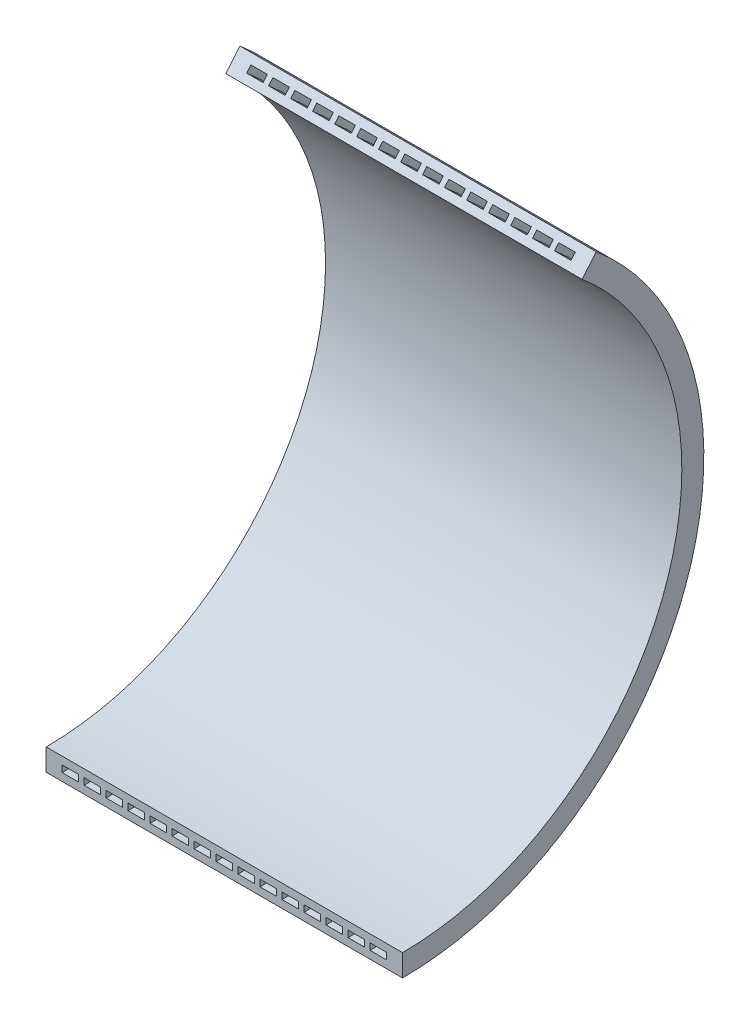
from build123d import *

# Parameters (mm, degrees)
SKICA1_W       = 162
SKICA1_H       = 10
SKICA1_W_2     = 7.5
SKICA1_H_2     = 3
ROTOVAT1_ANGLE = 140
M_TKO1_SCALE   = 0.655


with BuildPart() as part:
    # Skica1 → Rotovat1 (revolve)
    with BuildSketch(Plane.XY):
        with Locations((73.75, 1.5)):
            Rectangle(SKICA1_W, SKICA1_H)
        with Locations((13.75, 1.5)):
            Rectangle(SKICA1_W_2, SKICA1_H_2, mode=Mode.SUBTRACT)
        with Locations((3.75, 1.5)):
            Rectangle(SKICA1_W_2, SKICA1_H_2, mode=Mode.SUBTRACT)
        with Locations((23.75, 1.5)):
            Rectangle(SKICA1_W_2, SKICA1_H_2, mode=Mode.SUBTRACT)
        with Locations((33.75, 1.5)):
            Rectangle(SKICA1_W_2, SKICA1_H_2, mode=Mode.SUBTRACT)
        with Locations((43.75, 1.5)):
            Rectangle(SKICA1_W_2, SKICA1_H_2, mode=Mode.SUBTRACT)
        with Locations((53.75, 1.5)):
            Rectangle(SKICA1_W_2, SKICA1_H_2, mode=Mode.SUBTRACT)
        with Locations((63.75, 1.5)):
            Rectangle(SKICA1_W_2, SKICA1_H_2, mode=Mode.SUBTRACT)
        with Locations((73.75, 1.5)):
            Rectangle(SKICA1_W_2, SKICA1_H_2, mode=Mode.SUBTRACT)
        with Locations((83.75, 1.5)):
            Rectangle(SKICA1_W_2, SKICA1_H_2, mode=Mode.SUBTRACT)
        with Locations((93.75, 1.5)):
            Rectangle(SKICA1_W_2, SKICA1_H_2, mode=Mode.SUBTRACT)
        with Locations((103.75, 1.5)):
            Rectangle(SKICA1_W_2, SKICA1_H_2, mode=Mode.SUBTRACT)
        with Locations((113.75, 1.5)):
            Rectangle(SKICA1_W_2, SKICA1_H_2, mode=Mode.SUBTRACT)
        with Locations((123.75, 1.5)):
            Rectangle(SKICA1_W_2, SKICA1_H_2, mode=Mode.SUBTRACT)
        with Locations((133.75, 1.5)):
            Rectangle(SKICA1_W_2, SKICA1_H_2, mode=Mode.SUBTRACT)
        with Locations((143.75, 1.5)):
            Rectangle(SKICA1_W_2, SKICA1_H_2, mode=Mode.SUBTRACT)
    revolve(axis=Axis((-7.25, 133.5, 0), (1, 0, 0)), revolution_arc=ROTOVAT1_ANGLE)


with BuildPart() as part_1:
    # M_tko1: scaled about (0, 0, 0)
    add(part.part.scale(M_TKO1_SCALE))


solid = part_1.part
